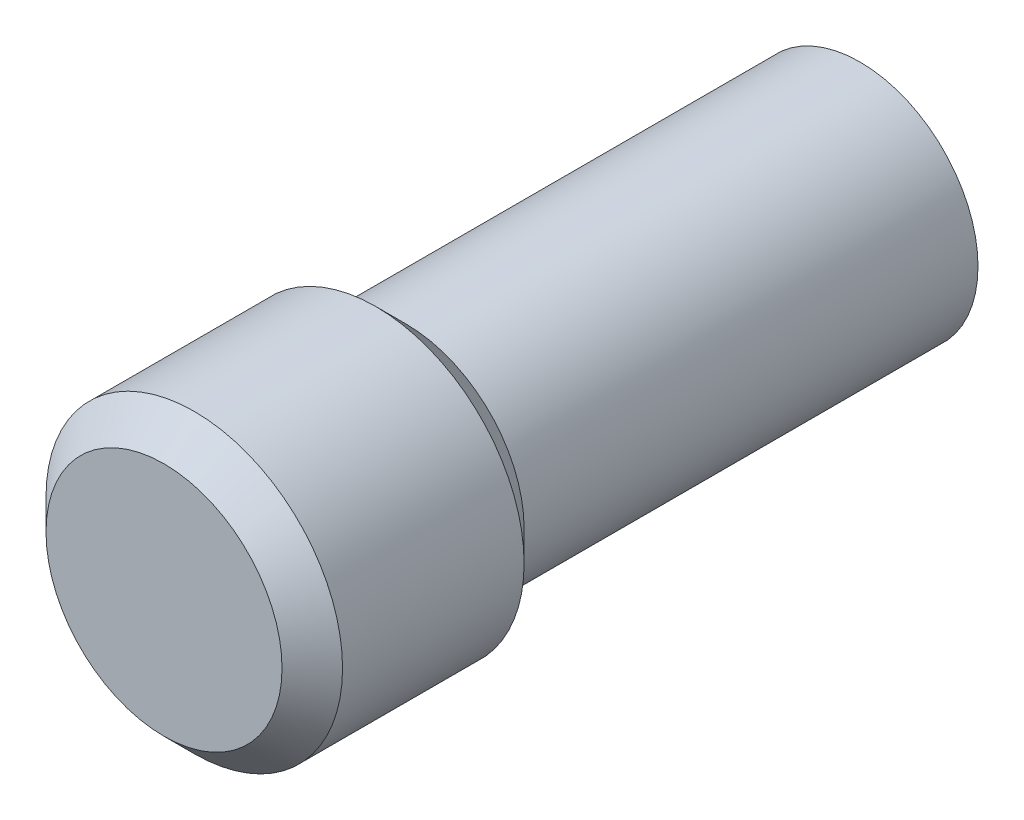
ISO-10303-21;
HEADER;
FILE_DESCRIPTION(('STEP AP214'),'2;1');
FILE_NAME('part.step','',(''),(''),'','','');
FILE_SCHEMA(('AUTOMOTIVE_DESIGN { 1 0 10303 214 1 1 1 1 }'));
ENDSEC;
DATA;
#1=APPLICATION_CONTEXT('core data for automotive mechanical design processes');
#2=APPLICATION_PROTOCOL_DEFINITION('international standard','automotive_design',2000,#1);
#3=PRODUCT_CONTEXT('',#1,'mechanical');
#4=PRODUCT('Part','Part','',(#3));
#5=PRODUCT_RELATED_PRODUCT_CATEGORY('part','',(#4));
#6=PRODUCT_DEFINITION_FORMATION('','',#4);
#7=PRODUCT_DEFINITION_CONTEXT('part definition',#1,'design');
#8=PRODUCT_DEFINITION('design','',#6,#7);
#9=PRODUCT_DEFINITION_SHAPE('','',#8);
#10=(LENGTH_UNIT() NAMED_UNIT(*) SI_UNIT(.MILLI.,.METRE.));
#11=(NAMED_UNIT(*) PLANE_ANGLE_UNIT() SI_UNIT($,.RADIAN.));
#12=(NAMED_UNIT(*) SI_UNIT($,.STERADIAN.) SOLID_ANGLE_UNIT());
#13=UNCERTAINTY_MEASURE_WITH_UNIT(LENGTH_MEASURE(1.E-05),#10,'distance_accuracy_value','');
#14=(GEOMETRIC_REPRESENTATION_CONTEXT(3) GLOBAL_UNCERTAINTY_ASSIGNED_CONTEXT((#13)) GLOBAL_UNIT_ASSIGNED_CONTEXT((#10,
#11,#12)) REPRESENTATION_CONTEXT('',''));
#15=CARTESIAN_POINT('',(0.,0.,0.));
#16=DIRECTION('',(0.,0.,1.));
#17=DIRECTION('',(1.,0.,0.));
#18=AXIS2_PLACEMENT_3D('',#15,#16,#17);
#19=CARTESIAN_POINT('',(0.,0.,15.));
#20=DIRECTION('',(0.,0.,-1.));
#21=DIRECTION('',(-1.,0.,0.));
#22=AXIS2_PLACEMENT_3D('',#19,#20,#21);
#23=CYLINDRICAL_SURFACE('',#22,3.9);
#24=CARTESIAN_POINT('',(0.,0.,15.));
#25=DIRECTION('',(0.,0.,1.));
#26=DIRECTION('',(1.,0.,0.));
#27=AXIS2_PLACEMENT_3D('',#24,#25,#26);
#28=CIRCLE('',#27,3.9);
#29=CARTESIAN_POINT('',(3.9,0.,15.));
#30=VERTEX_POINT('',#29);
#31=EDGE_CURVE('E49',#30,#30,#28,.T.);
#32=ORIENTED_EDGE('',*,*,#31,.F.);
#33=EDGE_LOOP('',(#32));
#34=FACE_BOUND('',#33,.T.);
#35=CARTESIAN_POINT('',(0.,0.,0.));
#36=DIRECTION('',(0.,0.,1.));
#37=DIRECTION('',(1.,0.,0.));
#38=AXIS2_PLACEMENT_3D('',#35,#36,#37);
#39=CIRCLE('',#38,3.9);
#40=CARTESIAN_POINT('',(3.9,0.,0.));
#41=VERTEX_POINT('',#40);
#42=EDGE_CURVE('E52',#41,#41,#39,.T.);
#43=ORIENTED_EDGE('',*,*,#42,.T.);
#44=EDGE_LOOP('',(#43));
#45=FACE_BOUND('',#44,.T.);
#46=ADVANCED_FACE('F33',(#34,#45),#23,.T.);
#47=CARTESIAN_POINT('',(0.,0.,0.));
#48=DIRECTION('',(0.,0.,1.));
#49=DIRECTION('',(1.,0.,0.));
#50=AXIS2_PLACEMENT_3D('',#47,#48,#49);
#51=PLANE('',#50);
#52=ORIENTED_EDGE('',*,*,#42,.F.);
#53=EDGE_LOOP('',(#52));
#54=FACE_BOUND('',#53,.T.);
#55=ADVANCED_FACE('F63',(#54),#51,.F.);
#56=CARTESIAN_POINT('',(0.,0.,23.));
#57=DIRECTION('',(0.,0.,-1.));
#58=DIRECTION('',(-1.,0.,0.));
#59=AXIS2_PLACEMENT_3D('',#56,#57,#58);
#60=CYLINDRICAL_SURFACE('',#59,4.9);
#61=CARTESIAN_POINT('',(0.,0.,16.));
#62=DIRECTION('',(0.,0.,1.));
#63=DIRECTION('',(1.,0.,0.));
#64=AXIS2_PLACEMENT_3D('',#61,#62,#63);
#65=CIRCLE('',#64,4.9);
#66=CARTESIAN_POINT('',(4.9,0.,16.));
#67=VERTEX_POINT('',#66);
#68=EDGE_CURVE('E41',#67,#67,#65,.T.);
#69=ORIENTED_EDGE('',*,*,#68,.T.);
#70=EDGE_LOOP('',(#69));
#71=FACE_BOUND('',#70,.T.);
#72=CARTESIAN_POINT('',(0.,0.,22.));
#73=DIRECTION('',(0.,0.,1.));
#74=DIRECTION('',(1.,0.,0.));
#75=AXIS2_PLACEMENT_3D('',#72,#73,#74);
#76=CIRCLE('',#75,4.9);
#77=CARTESIAN_POINT('',(4.9,0.,22.));
#78=VERTEX_POINT('',#77);
#79=EDGE_CURVE('E45',#78,#78,#76,.F.);
#80=ORIENTED_EDGE('',*,*,#79,.T.);
#81=EDGE_LOOP('',(#80));
#82=FACE_BOUND('',#81,.T.);
#83=ADVANCED_FACE('F68',(#71,#82),#60,.T.);
#84=CARTESIAN_POINT('',(0.,0.,23.));
#85=DIRECTION('',(0.,0.,1.));
#86=DIRECTION('',(1.,0.,0.));
#87=AXIS2_PLACEMENT_3D('',#84,#85,#86);
#88=PLANE('',#87);
#89=CARTESIAN_POINT('',(0.,0.,23.));
#90=DIRECTION('',(0.,0.,1.));
#91=DIRECTION('',(1.,0.,0.));
#92=AXIS2_PLACEMENT_3D('',#89,#90,#91);
#93=CIRCLE('',#92,3.9);
#94=CARTESIAN_POINT('',(3.9,0.,23.));
#95=VERTEX_POINT('',#94);
#96=EDGE_CURVE('E10',#95,#95,#93,.T.);
#97=ORIENTED_EDGE('',*,*,#96,.T.);
#98=EDGE_LOOP('',(#97));
#99=FACE_BOUND('',#98,.T.);
#100=ADVANCED_FACE('F73',(#99),#88,.T.);
#101=CARTESIAN_POINT('',(0.,0.,16.));
#102=DIRECTION('',(0.,0.,1.));
#103=DIRECTION('',(1.,0.,0.));
#104=AXIS2_PLACEMENT_3D('',#101,#102,#103);
#105=CONICAL_SURFACE('',#104,4.9,0.78539816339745);
#106=ORIENTED_EDGE('',*,*,#31,.T.);
#107=EDGE_LOOP('',(#106));
#108=FACE_BOUND('',#107,.T.);
#109=ORIENTED_EDGE('',*,*,#68,.F.);
#110=EDGE_LOOP('',(#109));
#111=FACE_BOUND('',#110,.T.);
#112=ADVANCED_FACE('F58',(#108,#111),#105,.T.);
#113=CARTESIAN_POINT('',(0.,0.,23.));
#114=DIRECTION('',(0.,0.,-1.));
#115=DIRECTION('',(-1.,0.,0.));
#116=AXIS2_PLACEMENT_3D('',#113,#114,#115);
#117=CONICAL_SURFACE('',#116,3.9,0.785398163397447);
#118=ORIENTED_EDGE('',*,*,#79,.F.);
#119=EDGE_LOOP('',(#118));
#120=FACE_BOUND('',#119,.T.);
#121=ORIENTED_EDGE('',*,*,#96,.F.);
#122=EDGE_LOOP('',(#121));
#123=FACE_BOUND('',#122,.T.);
#124=ADVANCED_FACE('F36',(#120,#123),#117,.T.);
#125=CLOSED_SHELL('',(#46,#55,#83,#100,#112,#124));
#126=MANIFOLD_SOLID_BREP('B2',#125);
#127=ADVANCED_BREP_SHAPE_REPRESENTATION('',(#18,#126),#14);
#128=SHAPE_DEFINITION_REPRESENTATION(#9,#127);
ENDSEC;
END-ISO-10303-21;
